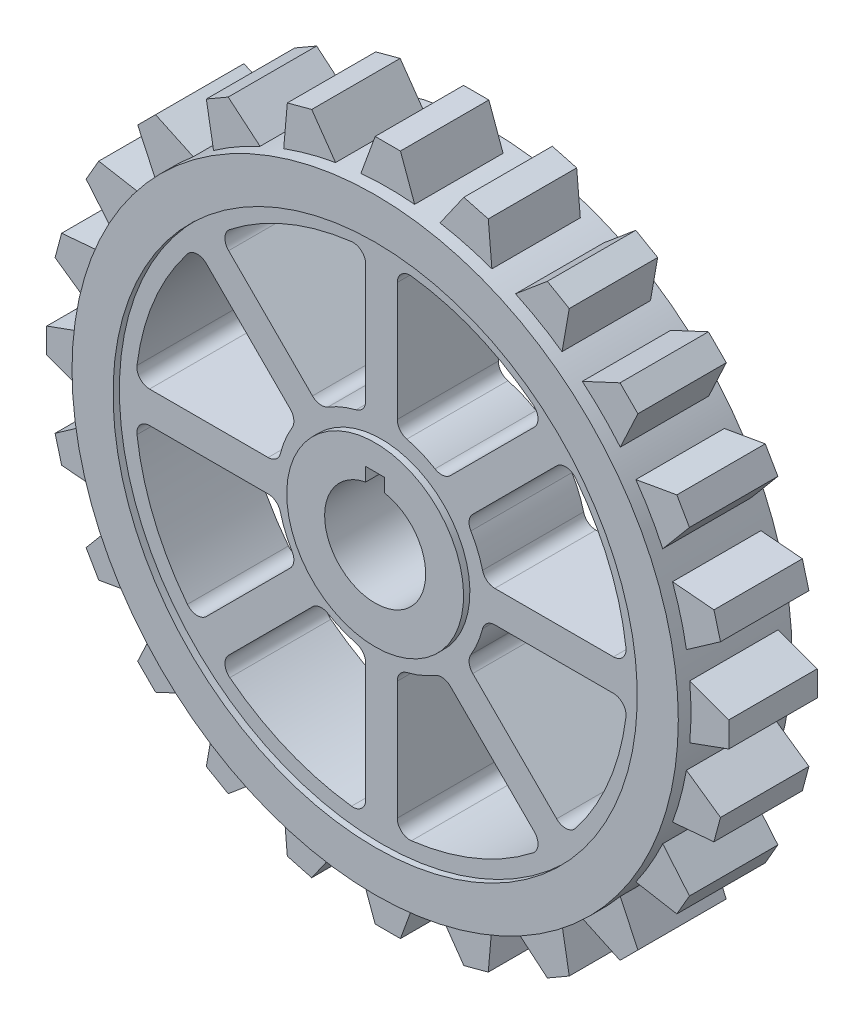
from build123d import *

# Parameters (mm, degrees)
SKETCH1_W          = 14
SKETCH1_H          = 1
SKETCH2_R          = 55
SKETCH2_W          = 3
SKETCH2_H          = 2.141883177
CUT_EXTRUDE1_DEPTH = 80.837334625


with BuildPart() as part:
    # Sketch1 → Revolve1 (revolve)
    with BuildSketch(Plane(origin=(0, 0, 0), x_dir=(0, 0, -1), z_dir=(1, 0, 0)), mode=Mode.PRIVATE) as revolve1_sk:
        with Locations((0, 54.5)):
            Rectangle(SKETCH1_W, SKETCH1_H)
        Polygon((-8, 14), (-9, 14), (-9, 8), (9, 8), (9, 14), (8, 14), (8, 41.5), (9, 41.5), (9, 48), (7, 48), (7, 54), (-7, 54), (-7, 48), (-9, 48), (-9, 41.5), (-8, 41.5), align=None)
    revolve(revolve1_sk.sketch.rotate(Axis((0, 0, 9), (0, 0, -1)), 180), axis=Axis((0, 0, 9), (0, 0, -1)))

    # Sketch2 → Cut-Extrude1 (cut, through all)
    # profile 1 of 10: a face of its own
    with BuildSketch(Plane.XY.offset(9)):
        Circle(SKETCH2_R)
        with BuildLine():
            Line((-2, 54), (2, 54))
            Line((2, 54), (4.252519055, 47.81125476))
            ThreePointArc((4.252519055, 47.81125476), (6.265257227, 47.589353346), (8.26684532, 47.282758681))
            Line((8.26684532, 47.282758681), (12.044376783, 52.67763271))
            Line((12.044376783, 52.67763271), (15.908080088, 51.642356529))
            Line((15.908080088, 51.642356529), (16.482081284, 45.081492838))
            ThreePointArc((16.482081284, 45.081492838), (18.368804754, 44.346217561), (20.222837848, 43.532020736))
            Line((20.222837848, 43.532020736), (25.267949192, 47.765371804))
            Line((25.267949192, 47.765371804), (28.732050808, 45.765371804))
            Line((28.732050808, 45.765371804), (27.588416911, 39.279501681))
            ThreePointArc((27.588416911, 39.279501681), (29.220548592, 38.080960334), (30.800677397, 36.814647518))
            Line((30.800677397, 36.814647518), (36.769552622, 39.597979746))
            Line((36.769552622, 39.597979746), (39.597979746, 36.769552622))
            Line((39.597979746, 36.769552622), (36.814647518, 30.800677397))
            ThreePointArc((36.814647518, 30.800677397), (38.080960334, 29.220548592), (39.279501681, 27.588416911))
            Line((39.279501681, 27.588416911), (45.765371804, 28.732050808))
            Line((45.765371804, 28.732050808), (47.765371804, 25.267949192))
            Line((47.765371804, 25.267949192), (43.532020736, 20.222837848))
            ThreePointArc((43.532020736, 20.222837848), (44.346217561, 18.368804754), (45.081492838, 16.482081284))
            Line((45.081492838, 16.482081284), (51.642356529, 15.908080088))
            Line((51.642356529, 15.908080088), (52.67763271, 12.044376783))
            Line((52.67763271, 12.044376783), (47.282758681, 8.26684532))
            ThreePointArc((47.282758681, 8.26684532), (47.589353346, 6.265257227), (47.81125476, 4.252519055))
            Line((47.81125476, 4.252519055), (54, 2))
            Line((54, 2), (54, -2))
            Line((54, -2), (47.81125476, -4.252519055))
            ThreePointArc((47.81125476, -4.252519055), (47.589353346, -6.265257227), (47.282758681, -8.26684532))
            Line((47.282758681, -8.26684532), (52.67763271, -12.044376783))
            Line((52.67763271, -12.044376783), (51.642356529, -15.908080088))
            Line((51.642356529, -15.908080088), (45.081492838, -16.482081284))
            ThreePointArc((45.081492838, -16.482081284), (44.346217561, -18.368804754), (43.532020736, -20.222837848))
            Line((43.532020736, -20.222837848), (47.765371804, -25.267949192))
            Line((47.765371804, -25.267949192), (45.765371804, -28.732050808))
            Line((45.765371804, -28.732050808), (39.279501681, -27.588416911))
            ThreePointArc((39.279501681, -27.588416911), (38.080960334, -29.220548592), (36.814647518, -30.800677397))
            Line((36.814647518, -30.800677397), (39.597979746, -36.769552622))
            Line((39.597979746, -36.769552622), (36.769552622, -39.597979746))
            Line((36.769552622, -39.597979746), (30.800677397, -36.814647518))
            ThreePointArc((30.800677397, -36.814647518), (29.220548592, -38.080960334), (27.588416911, -39.279501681))
            Line((27.588416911, -39.279501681), (28.732050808, -45.765371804))
            Line((28.732050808, -45.765371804), (25.267949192, -47.765371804))
            Line((25.267949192, -47.765371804), (20.222837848, -43.532020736))
            ThreePointArc((20.222837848, -43.532020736), (18.368804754, -44.346217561), (16.482081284, -45.081492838))
            Line((16.482081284, -45.081492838), (15.908080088, -51.642356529))
            Line((15.908080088, -51.642356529), (12.044376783, -52.67763271))
            Line((12.044376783, -52.67763271), (8.26684532, -47.282758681))
            ThreePointArc((8.26684532, -47.282758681), (6.265257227, -47.589353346), (4.252519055, -47.81125476))
            Line((4.252519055, -47.81125476), (2, -54))
            Line((2, -54), (-2, -54))
            Line((-2, -54), (-4.252519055, -47.81125476))
            ThreePointArc((-4.252519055, -47.81125476), (-6.265257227, -47.589353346), (-8.26684532, -47.282758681))
            Line((-8.26684532, -47.282758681), (-12.044376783, -52.67763271))
            Line((-12.044376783, -52.67763271), (-15.908080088, -51.642356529))
            Line((-15.908080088, -51.642356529), (-16.482081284, -45.081492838))
            ThreePointArc((-16.482081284, -45.081492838), (-18.368804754, -44.346217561), (-20.222837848, -43.532020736))
            Line((-20.222837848, -43.532020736), (-25.267949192, -47.765371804))
            Line((-25.267949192, -47.765371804), (-28.732050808, -45.765371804))
            Line((-28.732050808, -45.765371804), (-27.588416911, -39.279501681))
            ThreePointArc((-27.588416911, -39.279501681), (-29.220548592, -38.080960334), (-30.800677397, -36.814647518))
            Line((-30.800677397, -36.814647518), (-36.769552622, -39.597979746))
            Line((-36.769552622, -39.597979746), (-39.597979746, -36.769552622))
            Line((-39.597979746, -36.769552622), (-36.814647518, -30.800677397))
            ThreePointArc((-36.814647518, -30.800677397), (-38.080960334, -29.220548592), (-39.279501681, -27.588416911))
            Line((-39.279501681, -27.588416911), (-45.765371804, -28.732050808))
            Line((-45.765371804, -28.732050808), (-47.765371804, -25.267949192))
            Line((-47.765371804, -25.267949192), (-43.532020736, -20.222837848))
            ThreePointArc((-43.532020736, -20.222837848), (-44.346217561, -18.368804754), (-45.081492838, -16.482081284))
            Line((-45.081492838, -16.482081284), (-51.642356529, -15.908080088))
            Line((-51.642356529, -15.908080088), (-52.67763271, -12.044376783))
            Line((-52.67763271, -12.044376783), (-47.282758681, -8.26684532))
            ThreePointArc((-47.282758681, -8.26684532), (-47.589353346, -6.265257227), (-47.81125476, -4.252519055))
            Line((-47.81125476, -4.252519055), (-54, -2))
            Line((-54, -2), (-54, 2))
            Line((-54, 2), (-47.81125476, 4.252519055))
            ThreePointArc((-47.81125476, 4.252519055), (-47.589353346, 6.265257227), (-47.282758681, 8.26684532))
            Line((-47.282758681, 8.26684532), (-52.67763271, 12.044376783))
            Line((-52.67763271, 12.044376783), (-51.642356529, 15.908080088))
            Line((-51.642356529, 15.908080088), (-45.081492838, 16.482081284))
            ThreePointArc((-45.081492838, 16.482081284), (-44.346217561, 18.368804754), (-43.532020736, 20.222837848))
            Line((-43.532020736, 20.222837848), (-47.765371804, 25.267949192))
            Line((-47.765371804, 25.267949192), (-45.765371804, 28.732050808))
            Line((-45.765371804, 28.732050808), (-39.279501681, 27.588416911))
            ThreePointArc((-39.279501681, 27.588416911), (-38.080960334, 29.220548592), (-36.814647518, 30.800677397))
            Line((-36.814647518, 30.800677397), (-39.597979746, 36.769552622))
            Line((-39.597979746, 36.769552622), (-36.769552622, 39.597979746))
            Line((-36.769552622, 39.597979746), (-30.800677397, 36.814647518))
            ThreePointArc((-30.800677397, 36.814647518), (-29.220548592, 38.080960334), (-27.588416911, 39.279501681))
            Line((-27.588416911, 39.279501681), (-28.732050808, 45.765371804))
            Line((-28.732050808, 45.765371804), (-25.267949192, 47.765371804))
            Line((-25.267949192, 47.765371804), (-20.222837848, 43.532020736))
            ThreePointArc((-20.222837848, 43.532020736), (-18.368804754, 44.346217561), (-16.482081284, 45.081492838))
            Line((-16.482081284, 45.081492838), (-15.908080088, 51.642356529))
            Line((-15.908080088, 51.642356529), (-12.044376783, 52.67763271))
            Line((-12.044376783, 52.67763271), (-8.26684532, 47.282758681))
            ThreePointArc((-8.26684532, 47.282758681), (-6.265257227, 47.589353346), (-4.252519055, 47.81125476))
            Line((-4.252519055, 47.81125476), (-2, 54))
        make_face(mode=Mode.SUBTRACT)
    # profile 2 of 10: a face of its own
    with BuildSketch(Plane.XY.offset(9)):
        with Locations((0, 8.929058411)):
            Rectangle(SKETCH2_W, SKETCH2_H)
    # profile 3 of 10: a face of its own
    with BuildSketch(Plane.XY.offset(9)):
        with BuildLine():
            Line((2.5, 36.725331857), (2.5, 17.944358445))
            ThreePointArc((2.5, 17.944358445), (2.923140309, 16.714109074), (4.013513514, 16.004427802))
            ThreePointArc((4.013513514, 16.004427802), (6.314276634, 15.244012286), (8.478856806, 14.15482205))
            ThreePointArc((8.478856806, 14.15482205), (9.751687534, 13.885632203), (10.920810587, 14.456344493))
            Line((10.920810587, 14.456344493), (24.200964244, 27.73649815))
            ThreePointArc((24.200964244, 27.73649815), (24.7830355, 29.272559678), (24.018466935, 30.726425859))
            ThreePointArc((24.018466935, 30.726425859), (14.924653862, 36.031301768), (4.743243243, 38.71048493))
            ThreePointArc((4.743243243, 38.71048493), (3.174572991, 38.223077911), (2.5, 36.725331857))
        make_face()
    # profile 4 of 10: a face of its own
    with BuildSketch(Plane.XY.offset(9)):
        with BuildLine():
            Line((27.73649815, 24.200964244), (14.456344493, 10.920810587))
            ThreePointArc((14.456344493, 10.920810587), (13.885632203, 9.751687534), (14.15482205, 8.478856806))
            ThreePointArc((14.15482205, 8.478856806), (15.244012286, 6.314276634), (16.004427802, 4.013513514))
            ThreePointArc((16.004427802, 4.013513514), (16.714109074, 2.923140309), (17.944358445, 2.5))
            Line((17.944358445, 2.5), (36.725331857, 2.5))
            ThreePointArc((36.725331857, 2.5), (38.223077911, 3.174572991), (38.71048493, 4.743243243))
            ThreePointArc((38.71048493, 4.743243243), (36.031301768, 14.924653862), (30.726425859, 24.018466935))
            ThreePointArc((30.726425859, 24.018466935), (29.272559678, 24.7830355), (27.73649815, 24.200964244))
        make_face()
    # profile 5 of 10: a face of its own
    with BuildSketch(Plane.XY.offset(9)):
        with BuildLine():
            Line((36.725331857, -2.5), (17.944358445, -2.5))
            ThreePointArc((17.944358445, -2.5), (16.714109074, -2.923140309), (16.004427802, -4.013513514))
            ThreePointArc((16.004427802, -4.013513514), (15.244012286, -6.314276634), (14.15482205, -8.478856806))
            ThreePointArc((14.15482205, -8.478856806), (13.885632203, -9.751687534), (14.456344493, -10.920810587))
            Line((14.456344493, -10.920810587), (27.73649815, -24.200964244))
            ThreePointArc((27.73649815, -24.200964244), (29.272559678, -24.7830355), (30.726425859, -24.018466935))
            ThreePointArc((30.726425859, -24.018466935), (36.031301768, -14.924653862), (38.71048493, -4.743243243))
            ThreePointArc((38.71048493, -4.743243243), (38.223077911, -3.174572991), (36.725331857, -2.5))
        make_face()
    # profile 6 of 10: a face of its own
    with BuildSketch(Plane.XY.offset(9)):
        with BuildLine():
            Line((24.200964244, -27.73649815), (10.920810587, -14.456344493))
            ThreePointArc((10.920810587, -14.456344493), (9.751687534, -13.885632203), (8.478856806, -14.15482205))
            ThreePointArc((8.478856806, -14.15482205), (6.314276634, -15.244012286), (4.013513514, -16.004427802))
            ThreePointArc((4.013513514, -16.004427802), (2.923140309, -16.714109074), (2.5, -17.944358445))
            Line((2.5, -17.944358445), (2.5, -36.725331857))
            ThreePointArc((2.5, -36.725331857), (3.174572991, -38.223077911), (4.743243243, -38.71048493))
            ThreePointArc((4.743243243, -38.71048493), (14.924653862, -36.031301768), (24.018466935, -30.726425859))
            ThreePointArc((24.018466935, -30.726425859), (24.7830355, -29.272559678), (24.200964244, -27.73649815))
        make_face()
    # profile 7 of 10: a face of its own
    with BuildSketch(Plane.XY.offset(9)):
        with BuildLine():
            Line((-2.5, -36.725331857), (-2.5, -17.944358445))
            ThreePointArc((-2.5, -17.944358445), (-2.923140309, -16.714109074), (-4.013513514, -16.004427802))
            ThreePointArc((-4.013513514, -16.004427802), (-6.314276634, -15.244012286), (-8.478856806, -14.15482205))
            ThreePointArc((-8.478856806, -14.15482205), (-9.751687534, -13.885632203), (-10.920810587, -14.456344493))
            Line((-10.920810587, -14.456344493), (-24.200964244, -27.73649815))
            ThreePointArc((-24.200964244, -27.73649815), (-24.7830355, -29.272559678), (-24.018466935, -30.726425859))
            ThreePointArc((-24.018466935, -30.726425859), (-14.924653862, -36.031301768), (-4.743243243, -38.71048493))
            ThreePointArc((-4.743243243, -38.71048493), (-3.174572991, -38.223077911), (-2.5, -36.725331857))
        make_face()
    # profile 8 of 10: a face of its own
    with BuildSketch(Plane.XY.offset(9)):
        with BuildLine():
            Line((-27.73649815, -24.200964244), (-14.456344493, -10.920810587))
            ThreePointArc((-14.456344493, -10.920810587), (-13.885632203, -9.751687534), (-14.15482205, -8.478856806))
            ThreePointArc((-14.15482205, -8.478856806), (-15.244012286, -6.314276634), (-16.004427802, -4.013513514))
            ThreePointArc((-16.004427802, -4.013513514), (-16.714109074, -2.923140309), (-17.944358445, -2.5))
            Line((-17.944358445, -2.5), (-36.725331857, -2.5))
            ThreePointArc((-36.725331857, -2.5), (-38.223077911, -3.174572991), (-38.71048493, -4.743243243))
            ThreePointArc((-38.71048493, -4.743243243), (-36.031301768, -14.924653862), (-30.726425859, -24.018466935))
            ThreePointArc((-30.726425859, -24.018466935), (-29.272559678, -24.7830355), (-27.73649815, -24.200964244))
        make_face()
    # profile 9 of 10: a face of its own
    with BuildSketch(Plane.XY.offset(9)):
        with BuildLine():
            Line((-36.725331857, 2.5), (-17.944358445, 2.5))
            ThreePointArc((-17.944358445, 2.5), (-16.714109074, 2.923140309), (-16.004427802, 4.013513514))
            ThreePointArc((-16.004427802, 4.013513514), (-15.244012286, 6.314276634), (-14.15482205, 8.478856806))
            ThreePointArc((-14.15482205, 8.478856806), (-13.885632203, 9.751687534), (-14.456344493, 10.920810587))
            Line((-14.456344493, 10.920810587), (-27.73649815, 24.200964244))
            ThreePointArc((-27.73649815, 24.200964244), (-29.272559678, 24.7830355), (-30.726425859, 24.018466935))
            ThreePointArc((-30.726425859, 24.018466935), (-36.031301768, 14.924653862), (-38.71048493, 4.743243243))
            ThreePointArc((-38.71048493, 4.743243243), (-38.223077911, 3.174572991), (-36.725331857, 2.5))
        make_face()
    # profile 10 of 10: a face of its own
    with BuildSketch(Plane.XY.offset(9)):
        with BuildLine():
            Line((-24.200964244, 27.73649815), (-10.920810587, 14.456344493))
            ThreePointArc((-10.920810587, 14.456344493), (-9.751687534, 13.885632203), (-8.478856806, 14.15482205))
            ThreePointArc((-8.478856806, 14.15482205), (-6.314276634, 15.244012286), (-4.013513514, 16.004427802))
            ThreePointArc((-4.013513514, 16.004427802), (-2.923140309, 16.714109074), (-2.5, 17.944358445))
            Line((-2.5, 17.944358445), (-2.5, 36.725331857))
            ThreePointArc((-2.5, 36.725331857), (-3.174572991, 38.223077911), (-4.743243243, 38.71048493))
            ThreePointArc((-4.743243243, 38.71048493), (-14.924653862, 36.031301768), (-24.018466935, 30.726425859))
            ThreePointArc((-24.018466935, 30.726425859), (-24.7830355, 29.272559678), (-24.200964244, 27.73649815))
        make_face()
    extrude(amount=-CUT_EXTRUDE1_DEPTH, mode=Mode.SUBTRACT)


solid = part.part
